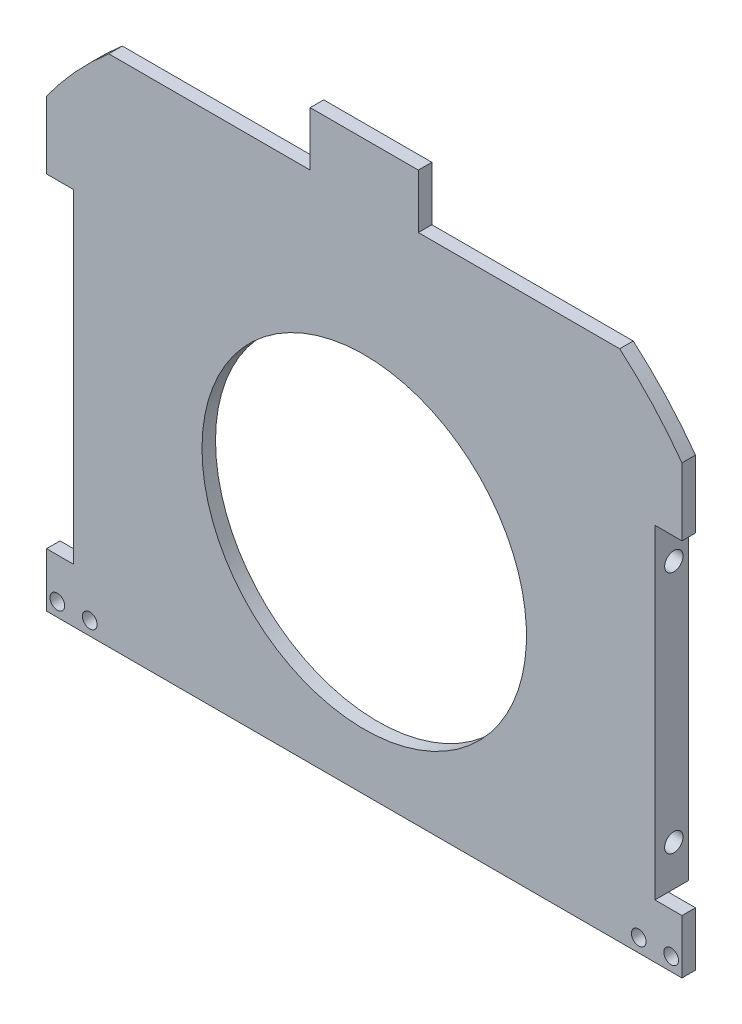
ISO-10303-21;
HEADER;
FILE_DESCRIPTION(('STEP AP214'),'2;1');
FILE_NAME('part.step','',(''),(''),'','','');
FILE_SCHEMA(('AUTOMOTIVE_DESIGN { 1 0 10303 214 1 1 1 1 }'));
ENDSEC;
DATA;
#1=APPLICATION_CONTEXT('core data for automotive mechanical design processes');
#2=APPLICATION_PROTOCOL_DEFINITION('international standard','automotive_design',2000,#1);
#3=PRODUCT_CONTEXT('',#1,'mechanical');
#4=PRODUCT('Part','Part','',(#3));
#5=PRODUCT_RELATED_PRODUCT_CATEGORY('part','',(#4));
#6=PRODUCT_DEFINITION_FORMATION('','',#4);
#7=PRODUCT_DEFINITION_CONTEXT('part definition',#1,'design');
#8=PRODUCT_DEFINITION('design','',#6,#7);
#9=PRODUCT_DEFINITION_SHAPE('','',#8);
#10=(LENGTH_UNIT() NAMED_UNIT(*) SI_UNIT(.MILLI.,.METRE.));
#11=(NAMED_UNIT(*) PLANE_ANGLE_UNIT() SI_UNIT($,.RADIAN.));
#12=(NAMED_UNIT(*) SI_UNIT($,.STERADIAN.) SOLID_ANGLE_UNIT());
#13=UNCERTAINTY_MEASURE_WITH_UNIT(LENGTH_MEASURE(1.E-05),#10,'distance_accuracy_value','');
#14=(GEOMETRIC_REPRESENTATION_CONTEXT(3) GLOBAL_UNCERTAINTY_ASSIGNED_CONTEXT((#13)) GLOBAL_UNIT_ASSIGNED_CONTEXT((#10,
#11,#12)) REPRESENTATION_CONTEXT('',''));
#15=CARTESIAN_POINT('',(0.,0.,0.));
#16=DIRECTION('',(0.,0.,1.));
#17=DIRECTION('',(1.,0.,0.));
#18=AXIS2_PLACEMENT_3D('',#15,#16,#17);
#19=CARTESIAN_POINT('',(7.93749999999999,-12.7,0.));
#20=DIRECTION('',(0.,0.,1.));
#21=DIRECTION('',(1.,0.,0.));
#22=AXIS2_PLACEMENT_3D('',#19,#20,#21);
#23=PLANE('',#22);
#24=CARTESIAN_POINT('',(7.93749999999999,-12.1424287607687,0.));
#25=DIRECTION('',(0.,0.,-1.));
#26=DIRECTION('',(-1.,0.,0.));
#27=AXIS2_PLACEMENT_3D('',#24,#25,#26);
#28=CIRCLE('',#27,38.1);
#29=CARTESIAN_POINT('',(-30.1625,-12.1424287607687,0.));
#30=VERTEX_POINT('',#29);
#31=EDGE_CURVE('E292',#30,#30,#28,.T.);
#32=ORIENTED_EDGE('',*,*,#31,.F.);
#33=EDGE_LOOP('',(#32));
#34=FACE_BOUND('',#33,.T.);
#35=CARTESIAN_POINT('',(80.01,-60.3466780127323,0.));
#36=DIRECTION('',(0.,0.,1.));
#37=DIRECTION('',(1.,0.,0.));
#38=AXIS2_PLACEMENT_3D('',#35,#36,#37);
#39=CIRCLE('',#38,1.7272);
#40=CARTESIAN_POINT('',(81.7372,-60.3466780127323,0.));
#41=VERTEX_POINT('',#40);
#42=EDGE_CURVE('E364',#41,#41,#39,.T.);
#43=ORIENTED_EDGE('',*,*,#42,.T.);
#44=EDGE_LOOP('',(#43));
#45=FACE_BOUND('',#44,.T.);
#46=CARTESIAN_POINT('',(-64.135,-60.3033219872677,0.));
#47=DIRECTION('',(0.,0.,1.));
#48=DIRECTION('',(1.,0.,0.));
#49=AXIS2_PLACEMENT_3D('',#46,#47,#48);
#50=CIRCLE('',#49,1.7272);
#51=CARTESIAN_POINT('',(-62.4078,-60.3033219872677,0.));
#52=VERTEX_POINT('',#51);
#53=EDGE_CURVE('E376',#52,#52,#50,.T.);
#54=ORIENTED_EDGE('',*,*,#53,.T.);
#55=EDGE_LOOP('',(#54));
#56=FACE_BOUND('',#55,.T.);
#57=CARTESIAN_POINT('',(-56.515,-60.3033219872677,0.));
#58=DIRECTION('',(0.,0.,1.));
#59=DIRECTION('',(1.,0.,0.));
#60=AXIS2_PLACEMENT_3D('',#57,#58,#59);
#61=CIRCLE('',#60,1.7272);
#62=CARTESIAN_POINT('',(-54.7878,-60.3033219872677,0.));
#63=VERTEX_POINT('',#62);
#64=EDGE_CURVE('E370',#63,#63,#61,.T.);
#65=ORIENTED_EDGE('',*,*,#64,.T.);
#66=EDGE_LOOP('',(#65));
#67=FACE_BOUND('',#66,.T.);
#68=CARTESIAN_POINT('',(72.39,-60.3466780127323,0.));
#69=DIRECTION('',(0.,0.,1.));
#70=DIRECTION('',(1.,0.,0.));
#71=AXIS2_PLACEMENT_3D('',#68,#69,#70);
#72=CIRCLE('',#71,1.7272);
#73=CARTESIAN_POINT('',(74.1172,-60.3466780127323,0.));
#74=VERTEX_POINT('',#73);
#75=EDGE_CURVE('E358',#74,#74,#72,.T.);
#76=ORIENTED_EDGE('',*,*,#75,.T.);
#77=EDGE_LOOP('',(#76));
#78=FACE_BOUND('',#77,.T.);
#79=DIRECTION('',(0.,1.,0.));
#80=VECTOR('',#79,1.);
#81=CARTESIAN_POINT('',(69.85,-12.7,0.));
#82=LINE('',#81,#80);
#83=CARTESIAN_POINT('',(69.85,14.1290386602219,0.));
#84=VERTEX_POINT('',#83);
#85=CARTESIAN_POINT('',(69.85,17.6209613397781,0.));
#86=VERTEX_POINT('',#85);
#87=EDGE_CURVE('E11',#84,#86,#82,.T.);
#88=ORIENTED_EDGE('',*,*,#87,.F.);
#89=DIRECTION('',(1.,0.,0.));
#90=VECTOR('',#89,1.);
#91=CARTESIAN_POINT('',(69.85,14.1290386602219,0.));
#92=LINE('',#91,#90);
#93=CARTESIAN_POINT('',(71.4375,14.1290386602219,0.));
#94=VERTEX_POINT('',#93);
#95=EDGE_CURVE('E248',#84,#94,#92,.T.);
#96=ORIENTED_EDGE('',*,*,#95,.T.);
#97=DIRECTION('',(0.,1.,0.));
#98=VECTOR('',#97,1.);
#99=CARTESIAN_POINT('',(71.4375,25.4,0.));
#100=LINE('',#99,#98);
#101=CARTESIAN_POINT('',(71.4375,-39.5290386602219,0.));
#102=VERTEX_POINT('',#101);
#103=EDGE_CURVE('E304',#102,#94,#100,.T.);
#104=ORIENTED_EDGE('',*,*,#103,.F.);
#105=DIRECTION('',(1.,0.,0.));
#106=VECTOR('',#105,1.);
#107=CARTESIAN_POINT('',(69.85,-39.5290386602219,0.));
#108=LINE('',#107,#106);
#109=CARTESIAN_POINT('',(69.85,-39.5290386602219,0.));
#110=VERTEX_POINT('',#109);
#111=EDGE_CURVE('E56',#102,#110,#108,.F.);
#112=ORIENTED_EDGE('',*,*,#111,.T.);
#113=DIRECTION('',(0.,1.,0.));
#114=VECTOR('',#113,1.);
#115=CARTESIAN_POINT('',(69.85,-12.7,0.));
#116=LINE('',#115,#114);
#117=CARTESIAN_POINT('',(69.85,-43.0209613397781,0.));
#118=VERTEX_POINT('',#117);
#119=EDGE_CURVE('E519',#118,#110,#116,.T.);
#120=ORIENTED_EDGE('',*,*,#119,.F.);
#121=DIRECTION('',(1.,0.,0.));
#122=VECTOR('',#121,1.);
#123=CARTESIAN_POINT('',(69.85,-43.0209613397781,0.));
#124=LINE('',#123,#122);
#125=CARTESIAN_POINT('',(71.4375,-43.0209613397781,0.));
#126=VERTEX_POINT('',#125);
#127=EDGE_CURVE('E265',#118,#126,#124,.T.);
#128=ORIENTED_EDGE('',*,*,#127,.T.);
#129=CARTESIAN_POINT('',(71.4375,-50.8,0.));
#130=VERTEX_POINT('',#129);
#131=EDGE_CURVE('E300',#130,#126,#100,.T.);
#132=ORIENTED_EDGE('',*,*,#131,.F.);
#133=DIRECTION('',(-1.,0.,0.));
#134=VECTOR('',#133,1.);
#135=CARTESIAN_POINT('',(76.2,-50.8,0.));
#136=LINE('',#135,#134);
#137=CARTESIAN_POINT('',(76.2,-50.8,0.));
#138=VERTEX_POINT('',#137);
#139=EDGE_CURVE('E298',#138,#130,#136,.T.);
#140=ORIENTED_EDGE('',*,*,#139,.F.);
#141=DIRECTION('',(-1.,0.,0.));
#142=VECTOR('',#141,1.);
#143=CARTESIAN_POINT('',(82.55,-50.8,0.));
#144=LINE('',#143,#142);
#145=CARTESIAN_POINT('',(82.55,-50.8,0.));
#146=VERTEX_POINT('',#145);
#147=EDGE_CURVE('E385',#146,#138,#144,.T.);
#148=ORIENTED_EDGE('',*,*,#147,.F.);
#149=DIRECTION('',(0.,1.,0.));
#150=VECTOR('',#149,1.);
#151=CARTESIAN_POINT('',(82.55,-50.8,0.));
#152=LINE('',#151,#150);
#153=CARTESIAN_POINT('',(82.55,-63.5,0.));
#154=VERTEX_POINT('',#153);
#155=EDGE_CURVE('E382',#154,#146,#152,.T.);
#156=ORIENTED_EDGE('',*,*,#155,.F.);
#157=DIRECTION('',(1.,0.,0.));
#158=VECTOR('',#157,1.);
#159=CARTESIAN_POINT('',(-66.675,-63.5,0.));
#160=LINE('',#159,#158);
#161=CARTESIAN_POINT('',(-66.675,-63.5,0.));
#162=VERTEX_POINT('',#161);
#163=EDGE_CURVE('E415',#162,#154,#160,.T.);
#164=ORIENTED_EDGE('',*,*,#163,.F.);
#165=DIRECTION('',(0.,-1.,0.));
#166=VECTOR('',#165,1.);
#167=CARTESIAN_POINT('',(-66.675,-50.8,0.));
#168=LINE('',#167,#166);
#169=CARTESIAN_POINT('',(-66.675,-50.8,0.));
#170=VERTEX_POINT('',#169);
#171=EDGE_CURVE('E413',#170,#162,#168,.T.);
#172=ORIENTED_EDGE('',*,*,#171,.F.);
#173=DIRECTION('',(-1.,0.,0.));
#174=VECTOR('',#173,1.);
#175=CARTESIAN_POINT('',(-60.325,-50.8,0.));
#176=LINE('',#175,#174);
#177=CARTESIAN_POINT('',(-60.325,-50.8,0.));
#178=VERTEX_POINT('',#177);
#179=EDGE_CURVE('E411',#178,#170,#176,.T.);
#180=ORIENTED_EDGE('',*,*,#179,.F.);
#181=DIRECTION('',(-1.,0.,0.));
#182=VECTOR('',#181,1.);
#183=CARTESIAN_POINT('',(-60.325,-50.8,0.));
#184=LINE('',#183,#182);
#185=CARTESIAN_POINT('',(-55.5625,-50.8,0.));
#186=VERTEX_POINT('',#185);
#187=EDGE_CURVE('E333',#186,#178,#184,.T.);
#188=ORIENTED_EDGE('',*,*,#187,.F.);
#189=DIRECTION('',(0.,-1.,0.));
#190=VECTOR('',#189,1.);
#191=CARTESIAN_POINT('',(-55.5625,25.4,0.));
#192=LINE('',#191,#190);
#193=CARTESIAN_POINT('',(-55.5625,-43.0209613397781,0.));
#194=VERTEX_POINT('',#193);
#195=EDGE_CURVE('E329',#194,#186,#192,.T.);
#196=ORIENTED_EDGE('',*,*,#195,.F.);
#197=DIRECTION('',(-1.,0.,0.));
#198=VECTOR('',#197,1.);
#199=CARTESIAN_POINT('',(-53.975,-43.0209613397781,0.));
#200=LINE('',#199,#198);
#201=CARTESIAN_POINT('',(-53.975,-43.0209613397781,0.));
#202=VERTEX_POINT('',#201);
#203=EDGE_CURVE('E274',#194,#202,#200,.F.);
#204=ORIENTED_EDGE('',*,*,#203,.T.);
#205=DIRECTION('',(0.,-1.,0.));
#206=VECTOR('',#205,1.);
#207=CARTESIAN_POINT('',(-53.975,-12.7,0.));
#208=LINE('',#207,#206);
#209=CARTESIAN_POINT('',(-53.975,-39.5290386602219,0.));
#210=VERTEX_POINT('',#209);
#211=EDGE_CURVE('E515',#210,#202,#208,.T.);
#212=ORIENTED_EDGE('',*,*,#211,.F.);
#213=DIRECTION('',(-1.,0.,0.));
#214=VECTOR('',#213,1.);
#215=CARTESIAN_POINT('',(-53.975,-39.5290386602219,0.));
#216=LINE('',#215,#214);
#217=CARTESIAN_POINT('',(-55.5625,-39.5290386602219,0.));
#218=VERTEX_POINT('',#217);
#219=EDGE_CURVE('E277',#210,#218,#216,.T.);
#220=ORIENTED_EDGE('',*,*,#219,.T.);
#221=CARTESIAN_POINT('',(-55.5625,14.1290386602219,0.));
#222=VERTEX_POINT('',#221);
#223=EDGE_CURVE('E334',#222,#218,#192,.T.);
#224=ORIENTED_EDGE('',*,*,#223,.F.);
#225=DIRECTION('',(-1.,0.,0.));
#226=VECTOR('',#225,1.);
#227=CARTESIAN_POINT('',(-53.975,14.1290386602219,0.));
#228=LINE('',#227,#226);
#229=CARTESIAN_POINT('',(-53.975,14.1290386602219,0.));
#230=VERTEX_POINT('',#229);
#231=EDGE_CURVE('E286',#222,#230,#228,.F.);
#232=ORIENTED_EDGE('',*,*,#231,.T.);
#233=DIRECTION('',(0.,-1.,0.));
#234=VECTOR('',#233,1.);
#235=CARTESIAN_POINT('',(-53.975,-12.7,0.));
#236=LINE('',#235,#234);
#237=CARTESIAN_POINT('',(-53.975,17.6209613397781,0.));
#238=VERTEX_POINT('',#237);
#239=EDGE_CURVE('E510',#238,#230,#236,.T.);
#240=ORIENTED_EDGE('',*,*,#239,.F.);
#241=DIRECTION('',(-1.,0.,0.));
#242=VECTOR('',#241,1.);
#243=CARTESIAN_POINT('',(-53.975,17.6209613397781,0.));
#244=LINE('',#243,#242);
#245=CARTESIAN_POINT('',(-55.5625,17.6209613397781,0.));
#246=VERTEX_POINT('',#245);
#247=EDGE_CURVE('E289',#238,#246,#244,.T.);
#248=ORIENTED_EDGE('',*,*,#247,.T.);
#249=CARTESIAN_POINT('',(-55.5625,25.4,0.));
#250=VERTEX_POINT('',#249);
#251=EDGE_CURVE('E330',#250,#246,#192,.T.);
#252=ORIENTED_EDGE('',*,*,#251,.F.);
#253=DIRECTION('',(1.,0.,0.));
#254=VECTOR('',#253,1.);
#255=CARTESIAN_POINT('',(-60.325,25.4,0.));
#256=LINE('',#255,#254);
#257=CARTESIAN_POINT('',(-60.325,25.4,0.));
#258=VERTEX_POINT('',#257);
#259=EDGE_CURVE('E326',#258,#250,#256,.T.);
#260=ORIENTED_EDGE('',*,*,#259,.F.);
#261=DIRECTION('',(1.,0.,0.));
#262=VECTOR('',#261,1.);
#263=CARTESIAN_POINT('',(-66.675,25.4,0.));
#264=LINE('',#263,#262);
#265=CARTESIAN_POINT('',(-66.675,25.4,0.));
#266=VERTEX_POINT('',#265);
#267=EDGE_CURVE('E408',#266,#258,#264,.T.);
#268=ORIENTED_EDGE('',*,*,#267,.F.);
#269=DIRECTION('',(0.,-1.,0.));
#270=VECTOR('',#269,1.);
#271=CARTESIAN_POINT('',(-66.675,25.4,0.));
#272=LINE('',#271,#270);
#273=CARTESIAN_POINT('',(-66.675,41.2516493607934,0.));
#274=VERTEX_POINT('',#273);
#275=EDGE_CURVE('E406',#274,#266,#272,.T.);
#276=ORIENTED_EDGE('',*,*,#275,.F.);
#277=CARTESIAN_POINT('',(7.93749999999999,-12.7,0.));
#278=DIRECTION('',(0.,0.,1.));
#279=DIRECTION('',(1.,0.,0.));
#280=AXIS2_PLACEMENT_3D('',#277,#278,#279);
#281=CIRCLE('',#280,92.075);
#282=CARTESIAN_POINT('',(-52.0523585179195,57.15,0.));
#283=VERTEX_POINT('',#282);
#284=EDGE_CURVE('E404',#283,#274,#281,.T.);
#285=ORIENTED_EDGE('',*,*,#284,.F.);
#286=DIRECTION('',(-1.,0.,0.));
#287=VECTOR('',#286,1.);
#288=CARTESIAN_POINT('',(-4.7625,57.15,0.));
#289=LINE('',#288,#287);
#290=CARTESIAN_POINT('',(-4.7625,57.15,0.));
#291=VERTEX_POINT('',#290);
#292=EDGE_CURVE('E402',#291,#283,#289,.T.);
#293=ORIENTED_EDGE('',*,*,#292,.F.);
#294=DIRECTION('',(0.,-1.,0.));
#295=VECTOR('',#294,1.);
#296=CARTESIAN_POINT('',(-4.76250000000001,69.85,0.));
#297=LINE('',#296,#295);
#298=CARTESIAN_POINT('',(-4.76250000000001,69.85,0.));
#299=VERTEX_POINT('',#298);
#300=EDGE_CURVE('E400',#299,#291,#297,.T.);
#301=ORIENTED_EDGE('',*,*,#300,.F.);
#302=DIRECTION('',(-1.,0.,0.));
#303=VECTOR('',#302,1.);
#304=CARTESIAN_POINT('',(-4.76250000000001,69.85,0.));
#305=LINE('',#304,#303);
#306=CARTESIAN_POINT('',(20.6375,69.85,0.));
#307=VERTEX_POINT('',#306);
#308=EDGE_CURVE('E398',#307,#299,#305,.T.);
#309=ORIENTED_EDGE('',*,*,#308,.F.);
#310=DIRECTION('',(0.,1.,0.));
#311=VECTOR('',#310,1.);
#312=CARTESIAN_POINT('',(20.6375,69.85,0.));
#313=LINE('',#312,#311);
#314=CARTESIAN_POINT('',(20.6375,57.15,0.));
#315=VERTEX_POINT('',#314);
#316=EDGE_CURVE('E396',#315,#307,#313,.T.);
#317=ORIENTED_EDGE('',*,*,#316,.F.);
#318=DIRECTION('',(-1.,0.,0.));
#319=VECTOR('',#318,1.);
#320=CARTESIAN_POINT('',(67.9273585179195,57.15,0.));
#321=LINE('',#320,#319);
#322=CARTESIAN_POINT('',(67.9273585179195,57.15,0.));
#323=VERTEX_POINT('',#322);
#324=EDGE_CURVE('E394',#323,#315,#321,.T.);
#325=ORIENTED_EDGE('',*,*,#324,.F.);
#326=CARTESIAN_POINT('',(7.93749999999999,-12.7,0.));
#327=DIRECTION('',(0.,0.,1.));
#328=DIRECTION('',(1.,0.,0.));
#329=AXIS2_PLACEMENT_3D('',#326,#327,#328);
#330=CIRCLE('',#329,92.075);
#331=CARTESIAN_POINT('',(82.55,41.2516493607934,0.));
#332=VERTEX_POINT('',#331);
#333=EDGE_CURVE('E392',#332,#323,#330,.T.);
#334=ORIENTED_EDGE('',*,*,#333,.F.);
#335=DIRECTION('',(0.,1.,0.));
#336=VECTOR('',#335,1.);
#337=CARTESIAN_POINT('',(82.55,41.2516493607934,0.));
#338=LINE('',#337,#336);
#339=CARTESIAN_POINT('',(82.55,25.4,0.));
#340=VERTEX_POINT('',#339);
#341=EDGE_CURVE('E390',#340,#332,#338,.T.);
#342=ORIENTED_EDGE('',*,*,#341,.F.);
#343=DIRECTION('',(1.,0.,0.));
#344=VECTOR('',#343,1.);
#345=CARTESIAN_POINT('',(76.2,25.4,0.));
#346=LINE('',#345,#344);
#347=CARTESIAN_POINT('',(76.2,25.4,0.));
#348=VERTEX_POINT('',#347);
#349=EDGE_CURVE('E388',#348,#340,#346,.T.);
#350=ORIENTED_EDGE('',*,*,#349,.F.);
#351=DIRECTION('',(1.,0.,0.));
#352=VECTOR('',#351,1.);
#353=CARTESIAN_POINT('',(76.2,25.4,0.));
#354=LINE('',#353,#352);
#355=CARTESIAN_POINT('',(71.4375,25.4,0.));
#356=VERTEX_POINT('',#355);
#357=EDGE_CURVE('E303',#356,#348,#354,.T.);
#358=ORIENTED_EDGE('',*,*,#357,.F.);
#359=CARTESIAN_POINT('',(71.4375,17.6209613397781,0.));
#360=VERTEX_POINT('',#359);
#361=EDGE_CURVE('E253',#360,#356,#100,.T.);
#362=ORIENTED_EDGE('',*,*,#361,.F.);
#363=DIRECTION('',(1.,0.,0.));
#364=VECTOR('',#363,1.);
#365=CARTESIAN_POINT('',(69.85,17.6209613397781,0.));
#366=LINE('',#365,#364);
#367=EDGE_CURVE('E48',#360,#86,#366,.F.);
#368=ORIENTED_EDGE('',*,*,#367,.T.);
#369=EDGE_LOOP('',(#88,#96,#104,#112,#120,#128,#132,#140,#148,#156,#164,#172,#180,#188,#196,
#204,#212,#220,#224,#232,#240,#248,#252,#260,#268,#276,#285,#293,#301,#309,#317,#325,#334,#342,
#350,#358,#362,#368));
#370=FACE_BOUND('',#369,.T.);
#371=ADVANCED_FACE('F33',(#34,#45,#56,#67,#78,#370),#23,.F.);
#372=CARTESIAN_POINT('',(7.93749999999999,-12.7,3.175));
#373=DIRECTION('',(0.,0.,1.));
#374=DIRECTION('',(1.,0.,0.));
#375=AXIS2_PLACEMENT_3D('',#372,#373,#374);
#376=PLANE('',#375);
#377=CARTESIAN_POINT('',(7.93749999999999,-12.1424287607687,3.175));
#378=DIRECTION('',(0.,0.,-1.));
#379=DIRECTION('',(-1.,0.,0.));
#380=AXIS2_PLACEMENT_3D('',#377,#378,#379);
#381=CIRCLE('',#380,38.1);
#382=CARTESIAN_POINT('',(-30.1625,-12.1424287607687,3.175));
#383=VERTEX_POINT('',#382);
#384=EDGE_CURVE('E295',#383,#383,#381,.T.);
#385=ORIENTED_EDGE('',*,*,#384,.T.);
#386=EDGE_LOOP('',(#385));
#387=FACE_BOUND('',#386,.T.);
#388=CARTESIAN_POINT('',(80.01,-60.3466780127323,3.175));
#389=DIRECTION('',(0.,0.,1.));
#390=DIRECTION('',(1.,0.,0.));
#391=AXIS2_PLACEMENT_3D('',#388,#389,#390);
#392=CIRCLE('',#391,1.7272);
#393=CARTESIAN_POINT('',(81.7372,-60.3466780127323,3.175));
#394=VERTEX_POINT('',#393);
#395=EDGE_CURVE('E367',#394,#394,#392,.T.);
#396=ORIENTED_EDGE('',*,*,#395,.F.);
#397=EDGE_LOOP('',(#396));
#398=FACE_BOUND('',#397,.T.);
#399=CARTESIAN_POINT('',(-64.135,-60.3033219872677,3.175));
#400=DIRECTION('',(0.,0.,1.));
#401=DIRECTION('',(1.,0.,0.));
#402=AXIS2_PLACEMENT_3D('',#399,#400,#401);
#403=CIRCLE('',#402,1.7272);
#404=CARTESIAN_POINT('',(-62.4078,-60.3033219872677,3.175));
#405=VERTEX_POINT('',#404);
#406=EDGE_CURVE('E379',#405,#405,#403,.T.);
#407=ORIENTED_EDGE('',*,*,#406,.F.);
#408=EDGE_LOOP('',(#407));
#409=FACE_BOUND('',#408,.T.);
#410=DIRECTION('',(0.,1.,0.));
#411=VECTOR('',#410,1.);
#412=CARTESIAN_POINT('',(82.55,-50.8,3.175));
#413=LINE('',#412,#411);
#414=CARTESIAN_POINT('',(82.55,-63.5,3.175));
#415=VERTEX_POINT('',#414);
#416=CARTESIAN_POINT('',(82.55,-50.8,3.175));
#417=VERTEX_POINT('',#416);
#418=EDGE_CURVE('E417',#415,#417,#413,.T.);
#419=ORIENTED_EDGE('',*,*,#418,.T.);
#420=DIRECTION('',(-1.,0.,0.));
#421=VECTOR('',#420,1.);
#422=CARTESIAN_POINT('',(82.55,-50.8,3.175));
#423=LINE('',#422,#421);
#424=CARTESIAN_POINT('',(76.2,-50.8,3.175));
#425=VERTEX_POINT('',#424);
#426=EDGE_CURVE('E420',#417,#425,#423,.T.);
#427=ORIENTED_EDGE('',*,*,#426,.T.);
#428=DIRECTION('',(0.,1.,0.));
#429=VECTOR('',#428,1.);
#430=CARTESIAN_POINT('',(76.2,25.4,3.175));
#431=LINE('',#430,#429);
#432=CARTESIAN_POINT('',(76.2,25.4,3.175));
#433=VERTEX_POINT('',#432);
#434=EDGE_CURVE('E422',#425,#433,#431,.T.);
#435=ORIENTED_EDGE('',*,*,#434,.T.);
#436=DIRECTION('',(1.,0.,0.));
#437=VECTOR('',#436,1.);
#438=CARTESIAN_POINT('',(76.2,25.4,3.175));
#439=LINE('',#438,#437);
#440=CARTESIAN_POINT('',(82.55,25.4,3.175));
#441=VERTEX_POINT('',#440);
#442=EDGE_CURVE('E424',#433,#441,#439,.T.);
#443=ORIENTED_EDGE('',*,*,#442,.T.);
#444=DIRECTION('',(0.,1.,0.));
#445=VECTOR('',#444,1.);
#446=CARTESIAN_POINT('',(82.55,41.2516493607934,3.175));
#447=LINE('',#446,#445);
#448=CARTESIAN_POINT('',(82.55,41.2516493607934,3.175));
#449=VERTEX_POINT('',#448);
#450=EDGE_CURVE('E426',#441,#449,#447,.T.);
#451=ORIENTED_EDGE('',*,*,#450,.T.);
#452=CARTESIAN_POINT('',(7.93749999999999,-12.7,3.175));
#453=DIRECTION('',(0.,0.,1.));
#454=DIRECTION('',(1.,0.,0.));
#455=AXIS2_PLACEMENT_3D('',#452,#453,#454);
#456=CIRCLE('',#455,92.075);
#457=CARTESIAN_POINT('',(67.9273585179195,57.15,3.175));
#458=VERTEX_POINT('',#457);
#459=EDGE_CURVE('E428',#449,#458,#456,.T.);
#460=ORIENTED_EDGE('',*,*,#459,.T.);
#461=DIRECTION('',(-1.,0.,0.));
#462=VECTOR('',#461,1.);
#463=CARTESIAN_POINT('',(67.9273585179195,57.15,3.175));
#464=LINE('',#463,#462);
#465=CARTESIAN_POINT('',(20.6375,57.15,3.175));
#466=VERTEX_POINT('',#465);
#467=EDGE_CURVE('E430',#458,#466,#464,.T.);
#468=ORIENTED_EDGE('',*,*,#467,.T.);
#469=DIRECTION('',(0.,1.,0.));
#470=VECTOR('',#469,1.);
#471=CARTESIAN_POINT('',(20.6375,69.85,3.175));
#472=LINE('',#471,#470);
#473=CARTESIAN_POINT('',(20.6375,69.85,3.175));
#474=VERTEX_POINT('',#473);
#475=EDGE_CURVE('E432',#466,#474,#472,.T.);
#476=ORIENTED_EDGE('',*,*,#475,.T.);
#477=DIRECTION('',(-1.,0.,0.));
#478=VECTOR('',#477,1.);
#479=CARTESIAN_POINT('',(-4.76250000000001,69.85,3.175));
#480=LINE('',#479,#478);
#481=CARTESIAN_POINT('',(-4.76250000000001,69.85,3.175));
#482=VERTEX_POINT('',#481);
#483=EDGE_CURVE('E434',#474,#482,#480,.T.);
#484=ORIENTED_EDGE('',*,*,#483,.T.);
#485=DIRECTION('',(0.,-1.,0.));
#486=VECTOR('',#485,1.);
#487=CARTESIAN_POINT('',(-4.76250000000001,69.85,3.175));
#488=LINE('',#487,#486);
#489=CARTESIAN_POINT('',(-4.7625,57.15,3.175));
#490=VERTEX_POINT('',#489);
#491=EDGE_CURVE('E436',#482,#490,#488,.T.);
#492=ORIENTED_EDGE('',*,*,#491,.T.);
#493=DIRECTION('',(-1.,0.,0.));
#494=VECTOR('',#493,1.);
#495=CARTESIAN_POINT('',(-4.7625,57.15,3.175));
#496=LINE('',#495,#494);
#497=CARTESIAN_POINT('',(-52.0523585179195,57.15,3.175));
#498=VERTEX_POINT('',#497);
#499=EDGE_CURVE('E438',#490,#498,#496,.T.);
#500=ORIENTED_EDGE('',*,*,#499,.T.);
#501=CARTESIAN_POINT('',(7.93749999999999,-12.7,3.175));
#502=DIRECTION('',(0.,0.,1.));
#503=DIRECTION('',(1.,0.,0.));
#504=AXIS2_PLACEMENT_3D('',#501,#502,#503);
#505=CIRCLE('',#504,92.075);
#506=CARTESIAN_POINT('',(-66.675,41.2516493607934,3.175));
#507=VERTEX_POINT('',#506);
#508=EDGE_CURVE('E440',#498,#507,#505,.T.);
#509=ORIENTED_EDGE('',*,*,#508,.T.);
#510=DIRECTION('',(0.,-1.,0.));
#511=VECTOR('',#510,1.);
#512=CARTESIAN_POINT('',(-66.675,25.4,3.175));
#513=LINE('',#512,#511);
#514=CARTESIAN_POINT('',(-66.675,25.4,3.175));
#515=VERTEX_POINT('',#514);
#516=EDGE_CURVE('E442',#507,#515,#513,.T.);
#517=ORIENTED_EDGE('',*,*,#516,.T.);
#518=DIRECTION('',(1.,0.,0.));
#519=VECTOR('',#518,1.);
#520=CARTESIAN_POINT('',(-66.675,25.4,3.175));
#521=LINE('',#520,#519);
#522=CARTESIAN_POINT('',(-60.325,25.4,3.175));
#523=VERTEX_POINT('',#522);
#524=EDGE_CURVE('E444',#515,#523,#521,.T.);
#525=ORIENTED_EDGE('',*,*,#524,.T.);
#526=DIRECTION('',(0.,-1.,0.));
#527=VECTOR('',#526,1.);
#528=CARTESIAN_POINT('',(-60.325,25.4,3.175));
#529=LINE('',#528,#527);
#530=CARTESIAN_POINT('',(-60.325,-50.8,3.175));
#531=VERTEX_POINT('',#530);
#532=EDGE_CURVE('E446',#523,#531,#529,.T.);
#533=ORIENTED_EDGE('',*,*,#532,.T.);
#534=DIRECTION('',(-1.,0.,0.));
#535=VECTOR('',#534,1.);
#536=CARTESIAN_POINT('',(-60.325,-50.8,3.175));
#537=LINE('',#536,#535);
#538=CARTESIAN_POINT('',(-66.675,-50.8,3.175));
#539=VERTEX_POINT('',#538);
#540=EDGE_CURVE('E448',#531,#539,#537,.T.);
#541=ORIENTED_EDGE('',*,*,#540,.T.);
#542=DIRECTION('',(0.,-1.,0.));
#543=VECTOR('',#542,1.);
#544=CARTESIAN_POINT('',(-66.675,-50.8,3.175));
#545=LINE('',#544,#543);
#546=CARTESIAN_POINT('',(-66.675,-63.5,3.175));
#547=VERTEX_POINT('',#546);
#548=EDGE_CURVE('E450',#539,#547,#545,.T.);
#549=ORIENTED_EDGE('',*,*,#548,.T.);
#550=DIRECTION('',(1.,0.,0.));
#551=VECTOR('',#550,1.);
#552=CARTESIAN_POINT('',(-66.675,-63.5,3.175));
#553=LINE('',#552,#551);
#554=EDGE_CURVE('E452',#547,#415,#553,.T.);
#555=ORIENTED_EDGE('',*,*,#554,.T.);
#556=EDGE_LOOP('',(#419,#427,#435,#443,#451,#460,#468,#476,#484,#492,#500,#509,#517,#525,#533,
#541,#549,#555));
#557=FACE_BOUND('',#556,.T.);
#558=CARTESIAN_POINT('',(-56.515,-60.3033219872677,3.175));
#559=DIRECTION('',(0.,0.,1.));
#560=DIRECTION('',(1.,0.,0.));
#561=AXIS2_PLACEMENT_3D('',#558,#559,#560);
#562=CIRCLE('',#561,1.7272);
#563=CARTESIAN_POINT('',(-54.7878,-60.3033219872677,3.175));
#564=VERTEX_POINT('',#563);
#565=EDGE_CURVE('E373',#564,#564,#562,.T.);
#566=ORIENTED_EDGE('',*,*,#565,.F.);
#567=EDGE_LOOP('',(#566));
#568=FACE_BOUND('',#567,.T.);
#569=CARTESIAN_POINT('',(72.39,-60.3466780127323,3.175));
#570=DIRECTION('',(0.,0.,1.));
#571=DIRECTION('',(1.,0.,0.));
#572=AXIS2_PLACEMENT_3D('',#569,#570,#571);
#573=CIRCLE('',#572,1.7272);
#574=CARTESIAN_POINT('',(74.1172,-60.3466780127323,3.175));
#575=VERTEX_POINT('',#574);
#576=EDGE_CURVE('E361',#575,#575,#573,.T.);
#577=ORIENTED_EDGE('',*,*,#576,.F.);
#578=EDGE_LOOP('',(#577));
#579=FACE_BOUND('',#578,.T.);
#580=ADVANCED_FACE('F547',(#387,#398,#409,#557,#568,#579),#376,.T.);
#581=CARTESIAN_POINT('',(82.55,-50.8,3.175));
#582=DIRECTION('',(-1.,0.,0.));
#583=DIRECTION('',(0.,-1.,0.));
#584=AXIS2_PLACEMENT_3D('',#581,#582,#583);
#585=PLANE('',#584);
#586=ORIENTED_EDGE('',*,*,#155,.T.);
#587=DIRECTION('',(0.,0.,-1.));
#588=VECTOR('',#587,1.);
#589=CARTESIAN_POINT('',(82.55,-50.8,3.175));
#590=LINE('',#589,#588);
#591=EDGE_CURVE('E504',#417,#146,#590,.T.);
#592=ORIENTED_EDGE('',*,*,#591,.F.);
#593=ORIENTED_EDGE('',*,*,#418,.F.);
#594=DIRECTION('',(0.,0.,-1.));
#595=VECTOR('',#594,1.);
#596=CARTESIAN_POINT('',(82.55,-63.5,3.175));
#597=LINE('',#596,#595);
#598=EDGE_CURVE('E454',#415,#154,#597,.T.);
#599=ORIENTED_EDGE('',*,*,#598,.T.);
#600=EDGE_LOOP('',(#586,#592,#593,#599));
#601=FACE_BOUND('',#600,.T.);
#602=ADVANCED_FACE('F35',(#601),#585,.F.);
#603=CARTESIAN_POINT('',(82.55,-50.8,3.175));
#604=DIRECTION('',(0.,-1.,0.));
#605=DIRECTION('',(0.,0.,-1.));
#606=AXIS2_PLACEMENT_3D('',#603,#604,#605);
#607=PLANE('',#606);
#608=ORIENTED_EDGE('',*,*,#147,.T.);
#609=DIRECTION('',(0.,0.,-1.));
#610=VECTOR('',#609,1.);
#611=CARTESIAN_POINT('',(76.2,-50.8,3.175));
#612=LINE('',#611,#610);
#613=EDGE_CURVE('E501',#425,#138,#612,.T.);
#614=ORIENTED_EDGE('',*,*,#613,.F.);
#615=ORIENTED_EDGE('',*,*,#426,.F.);
#616=ORIENTED_EDGE('',*,*,#591,.T.);
#617=EDGE_LOOP('',(#608,#614,#615,#616));
#618=FACE_BOUND('',#617,.T.);
#619=ADVANCED_FACE('F537',(#618),#607,.F.);
#620=CARTESIAN_POINT('',(76.2,25.4,3.175));
#621=DIRECTION('',(-1.,0.,0.));
#622=DIRECTION('',(0.,-1.,0.));
#623=AXIS2_PLACEMENT_3D('',#620,#621,#622);
#624=PLANE('',#623);
#625=CARTESIAN_POINT('',(76.2,15.875,-1.2700000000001));
#626=DIRECTION('',(1.,0.,0.));
#627=DIRECTION('',(0.,1.,0.));
#628=AXIS2_PLACEMENT_3D('',#625,#626,#627);
#629=CIRCLE('',#628,2.15900000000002);
#630=CARTESIAN_POINT('',(76.2,18.034,-1.2700000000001));
#631=VERTEX_POINT('',#630);
#632=EDGE_CURVE('E249',#631,#631,#629,.T.);
#633=ORIENTED_EDGE('',*,*,#632,.F.);
#634=EDGE_LOOP('',(#633));
#635=FACE_BOUND('',#634,.T.);
#636=CARTESIAN_POINT('',(76.2,-41.275,-1.2700000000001));
#637=DIRECTION('',(1.,0.,0.));
#638=DIRECTION('',(0.,1.,0.));
#639=AXIS2_PLACEMENT_3D('',#636,#637,#638);
#640=CIRCLE('',#639,2.15900000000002);
#641=CARTESIAN_POINT('',(76.2,-39.116,-1.2700000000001));
#642=VERTEX_POINT('',#641);
#643=EDGE_CURVE('E255',#642,#642,#640,.T.);
#644=ORIENTED_EDGE('',*,*,#643,.F.);
#645=EDGE_LOOP('',(#644));
#646=FACE_BOUND('',#645,.T.);
#647=ORIENTED_EDGE('',*,*,#613,.T.);
#648=DIRECTION('',(0.,0.,1.));
#649=VECTOR('',#648,1.);
#650=CARTESIAN_POINT('',(76.2,-50.8,-4.7625));
#651=LINE('',#650,#649);
#652=CARTESIAN_POINT('',(76.2,-50.8,-4.7625));
#653=VERTEX_POINT('',#652);
#654=EDGE_CURVE('E324',#653,#138,#651,.T.);
#655=ORIENTED_EDGE('',*,*,#654,.F.);
#656=DIRECTION('',(0.,-1.,0.));
#657=VECTOR('',#656,1.);
#658=CARTESIAN_POINT('',(76.2,25.4,-4.7625));
#659=LINE('',#658,#657);
#660=CARTESIAN_POINT('',(76.2,25.4,-4.7625));
#661=VERTEX_POINT('',#660);
#662=EDGE_CURVE('E307',#661,#653,#659,.T.);
#663=ORIENTED_EDGE('',*,*,#662,.F.);
#664=DIRECTION('',(0.,0.,1.));
#665=VECTOR('',#664,1.);
#666=CARTESIAN_POINT('',(76.2,25.4,-4.7625));
#667=LINE('',#666,#665);
#668=EDGE_CURVE('E316',#661,#348,#667,.T.);
#669=ORIENTED_EDGE('',*,*,#668,.T.);
#670=DIRECTION('',(0.,0.,-1.));
#671=VECTOR('',#670,1.);
#672=CARTESIAN_POINT('',(76.2,25.4,3.175));
#673=LINE('',#672,#671);
#674=EDGE_CURVE('E498',#433,#348,#673,.T.);
#675=ORIENTED_EDGE('',*,*,#674,.F.);
#676=ORIENTED_EDGE('',*,*,#434,.F.);
#677=EDGE_LOOP('',(#647,#655,#663,#669,#675,#676));
#678=FACE_BOUND('',#677,.T.);
#679=ADVANCED_FACE('F542',(#635,#646,#678),#624,.F.);
#680=CARTESIAN_POINT('',(76.2,25.4,3.175));
#681=DIRECTION('',(0.,1.,0.));
#682=DIRECTION('',(0.,0.,1.));
#683=AXIS2_PLACEMENT_3D('',#680,#681,#682);
#684=PLANE('',#683);
#685=ORIENTED_EDGE('',*,*,#349,.T.);
#686=DIRECTION('',(0.,0.,-1.));
#687=VECTOR('',#686,1.);
#688=CARTESIAN_POINT('',(82.55,25.4,3.175));
#689=LINE('',#688,#687);
#690=EDGE_CURVE('E495',#441,#340,#689,.T.);
#691=ORIENTED_EDGE('',*,*,#690,.F.);
#692=ORIENTED_EDGE('',*,*,#442,.F.);
#693=ORIENTED_EDGE('',*,*,#674,.T.);
#694=EDGE_LOOP('',(#685,#691,#692,#693));
#695=FACE_BOUND('',#694,.T.);
#696=ADVANCED_FACE('F670',(#695),#684,.F.);
#697=CARTESIAN_POINT('',(82.55,41.2516493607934,3.175));
#698=DIRECTION('',(-1.,0.,0.));
#699=DIRECTION('',(0.,0.,1.));
#700=AXIS2_PLACEMENT_3D('',#697,#698,#699);
#701=PLANE('',#700);
#702=ORIENTED_EDGE('',*,*,#341,.T.);
#703=DIRECTION('',(0.,0.,-1.));
#704=VECTOR('',#703,1.);
#705=CARTESIAN_POINT('',(82.55,41.2516493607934,3.175));
#706=LINE('',#705,#704);
#707=EDGE_CURVE('E492',#449,#332,#706,.T.);
#708=ORIENTED_EDGE('',*,*,#707,.F.);
#709=ORIENTED_EDGE('',*,*,#450,.F.);
#710=ORIENTED_EDGE('',*,*,#690,.T.);
#711=EDGE_LOOP('',(#702,#708,#709,#710));
#712=FACE_BOUND('',#711,.T.);
#713=ADVANCED_FACE('F666',(#712),#701,.F.);
#714=CARTESIAN_POINT('',(7.93749999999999,-12.7,3.175));
#715=DIRECTION('',(0.,0.,-1.));
#716=DIRECTION('',(-1.,0.,0.));
#717=AXIS2_PLACEMENT_3D('',#714,#715,#716);
#718=CYLINDRICAL_SURFACE('',#717,92.075);
#719=ORIENTED_EDGE('',*,*,#333,.T.);
#720=DIRECTION('',(0.,0.,-1.));
#721=VECTOR('',#720,1.);
#722=CARTESIAN_POINT('',(67.9273585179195,57.15,3.175));
#723=LINE('',#722,#721);
#724=EDGE_CURVE('E489',#458,#323,#723,.T.);
#725=ORIENTED_EDGE('',*,*,#724,.F.);
#726=ORIENTED_EDGE('',*,*,#459,.F.);
#727=ORIENTED_EDGE('',*,*,#707,.T.);
#728=EDGE_LOOP('',(#719,#725,#726,#727));
#729=FACE_BOUND('',#728,.T.);
#730=ADVANCED_FACE('F662',(#729),#718,.T.);
#731=CARTESIAN_POINT('',(67.9273585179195,57.15,3.175));
#732=DIRECTION('',(0.,-1.,0.));
#733=DIRECTION('',(0.,0.,-1.));
#734=AXIS2_PLACEMENT_3D('',#731,#732,#733);
#735=PLANE('',#734);
#736=ORIENTED_EDGE('',*,*,#324,.T.);
#737=DIRECTION('',(0.,0.,-1.));
#738=VECTOR('',#737,1.);
#739=CARTESIAN_POINT('',(20.6375,57.15,3.175));
#740=LINE('',#739,#738);
#741=EDGE_CURVE('E486',#466,#315,#740,.T.);
#742=ORIENTED_EDGE('',*,*,#741,.F.);
#743=ORIENTED_EDGE('',*,*,#467,.F.);
#744=ORIENTED_EDGE('',*,*,#724,.T.);
#745=EDGE_LOOP('',(#736,#742,#743,#744));
#746=FACE_BOUND('',#745,.T.);
#747=ADVANCED_FACE('F658',(#746),#735,.F.);
#748=CARTESIAN_POINT('',(20.6375,69.85,3.175));
#749=DIRECTION('',(-1.,0.,0.));
#750=DIRECTION('',(0.,-1.,0.));
#751=AXIS2_PLACEMENT_3D('',#748,#749,#750);
#752=PLANE('',#751);
#753=ORIENTED_EDGE('',*,*,#316,.T.);
#754=DIRECTION('',(0.,0.,-1.));
#755=VECTOR('',#754,1.);
#756=CARTESIAN_POINT('',(20.6375,69.85,3.175));
#757=LINE('',#756,#755);
#758=EDGE_CURVE('E483',#474,#307,#757,.T.);
#759=ORIENTED_EDGE('',*,*,#758,.F.);
#760=ORIENTED_EDGE('',*,*,#475,.F.);
#761=ORIENTED_EDGE('',*,*,#741,.T.);
#762=EDGE_LOOP('',(#753,#759,#760,#761));
#763=FACE_BOUND('',#762,.T.);
#764=ADVANCED_FACE('F654',(#763),#752,.F.);
#765=CARTESIAN_POINT('',(-4.76250000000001,69.85,3.175));
#766=DIRECTION('',(0.,-1.,0.));
#767=DIRECTION('',(0.,0.,-1.));
#768=AXIS2_PLACEMENT_3D('',#765,#766,#767);
#769=PLANE('',#768);
#770=ORIENTED_EDGE('',*,*,#308,.T.);
#771=DIRECTION('',(0.,0.,-1.));
#772=VECTOR('',#771,1.);
#773=CARTESIAN_POINT('',(-4.76250000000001,69.85,3.175));
#774=LINE('',#773,#772);
#775=EDGE_CURVE('E480',#482,#299,#774,.T.);
#776=ORIENTED_EDGE('',*,*,#775,.F.);
#777=ORIENTED_EDGE('',*,*,#483,.F.);
#778=ORIENTED_EDGE('',*,*,#758,.T.);
#779=EDGE_LOOP('',(#770,#776,#777,#778));
#780=FACE_BOUND('',#779,.T.);
#781=ADVANCED_FACE('F650',(#780),#769,.F.);
#782=CARTESIAN_POINT('',(-4.76250000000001,69.85,3.175));
#783=DIRECTION('',(1.,0.,0.));
#784=DIRECTION('',(0.,1.,0.));
#785=AXIS2_PLACEMENT_3D('',#782,#783,#784);
#786=PLANE('',#785);
#787=ORIENTED_EDGE('',*,*,#300,.T.);
#788=DIRECTION('',(0.,0.,-1.));
#789=VECTOR('',#788,1.);
#790=CARTESIAN_POINT('',(-4.7625,57.15,3.175));
#791=LINE('',#790,#789);
#792=EDGE_CURVE('E477',#490,#291,#791,.T.);
#793=ORIENTED_EDGE('',*,*,#792,.F.);
#794=ORIENTED_EDGE('',*,*,#491,.F.);
#795=ORIENTED_EDGE('',*,*,#775,.T.);
#796=EDGE_LOOP('',(#787,#793,#794,#795));
#797=FACE_BOUND('',#796,.T.);
#798=ADVANCED_FACE('F646',(#797),#786,.F.);
#799=CARTESIAN_POINT('',(-4.7625,57.15,3.175));
#800=DIRECTION('',(0.,-1.,0.));
#801=DIRECTION('',(0.,0.,-1.));
#802=AXIS2_PLACEMENT_3D('',#799,#800,#801);
#803=PLANE('',#802);
#804=ORIENTED_EDGE('',*,*,#292,.T.);
#805=DIRECTION('',(0.,0.,-1.));
#806=VECTOR('',#805,1.);
#807=CARTESIAN_POINT('',(-52.0523585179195,57.15,3.175));
#808=LINE('',#807,#806);
#809=EDGE_CURVE('E474',#498,#283,#808,.T.);
#810=ORIENTED_EDGE('',*,*,#809,.F.);
#811=ORIENTED_EDGE('',*,*,#499,.F.);
#812=ORIENTED_EDGE('',*,*,#792,.T.);
#813=EDGE_LOOP('',(#804,#810,#811,#812));
#814=FACE_BOUND('',#813,.T.);
#815=ADVANCED_FACE('F642',(#814),#803,.F.);
#816=CARTESIAN_POINT('',(7.93749999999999,-12.7,3.175));
#817=DIRECTION('',(0.,0.,-1.));
#818=DIRECTION('',(-1.,0.,0.));
#819=AXIS2_PLACEMENT_3D('',#816,#817,#818);
#820=CYLINDRICAL_SURFACE('',#819,92.075);
#821=ORIENTED_EDGE('',*,*,#284,.T.);
#822=DIRECTION('',(0.,0.,-1.));
#823=VECTOR('',#822,1.);
#824=CARTESIAN_POINT('',(-66.675,41.2516493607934,3.175));
#825=LINE('',#824,#823);
#826=EDGE_CURVE('E471',#507,#274,#825,.T.);
#827=ORIENTED_EDGE('',*,*,#826,.F.);
#828=ORIENTED_EDGE('',*,*,#508,.F.);
#829=ORIENTED_EDGE('',*,*,#809,.T.);
#830=EDGE_LOOP('',(#821,#827,#828,#829));
#831=FACE_BOUND('',#830,.T.);
#832=ADVANCED_FACE('F638',(#831),#820,.T.);
#833=CARTESIAN_POINT('',(-66.675,25.4,3.175));
#834=DIRECTION('',(1.,0.,0.));
#835=DIRECTION('',(0.,0.,-1.));
#836=AXIS2_PLACEMENT_3D('',#833,#834,#835);
#837=PLANE('',#836);
#838=ORIENTED_EDGE('',*,*,#275,.T.);
#839=DIRECTION('',(0.,0.,-1.));
#840=VECTOR('',#839,1.);
#841=CARTESIAN_POINT('',(-66.675,25.4,3.175));
#842=LINE('',#841,#840);
#843=EDGE_CURVE('E468',#515,#266,#842,.T.);
#844=ORIENTED_EDGE('',*,*,#843,.F.);
#845=ORIENTED_EDGE('',*,*,#516,.F.);
#846=ORIENTED_EDGE('',*,*,#826,.T.);
#847=EDGE_LOOP('',(#838,#844,#845,#846));
#848=FACE_BOUND('',#847,.T.);
#849=ADVANCED_FACE('F634',(#848),#837,.F.);
#850=CARTESIAN_POINT('',(-66.675,25.4,3.175));
#851=DIRECTION('',(0.,1.,0.));
#852=DIRECTION('',(0.,0.,1.));
#853=AXIS2_PLACEMENT_3D('',#850,#851,#852);
#854=PLANE('',#853);
#855=ORIENTED_EDGE('',*,*,#267,.T.);
#856=DIRECTION('',(0.,0.,-1.));
#857=VECTOR('',#856,1.);
#858=CARTESIAN_POINT('',(-60.325,25.4,3.175));
#859=LINE('',#858,#857);
#860=EDGE_CURVE('E465',#523,#258,#859,.T.);
#861=ORIENTED_EDGE('',*,*,#860,.F.);
#862=ORIENTED_EDGE('',*,*,#524,.F.);
#863=ORIENTED_EDGE('',*,*,#843,.T.);
#864=EDGE_LOOP('',(#855,#861,#862,#863));
#865=FACE_BOUND('',#864,.T.);
#866=ADVANCED_FACE('F630',(#865),#854,.F.);
#867=CARTESIAN_POINT('',(-60.325,25.4,3.175));
#868=DIRECTION('',(1.,0.,0.));
#869=DIRECTION('',(0.,1.,0.));
#870=AXIS2_PLACEMENT_3D('',#867,#868,#869);
#871=PLANE('',#870);
#872=CARTESIAN_POINT('',(-60.325,-41.275,-1.2700000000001));
#873=DIRECTION('',(-1.,0.,0.));
#874=DIRECTION('',(0.,-1.,0.));
#875=AXIS2_PLACEMENT_3D('',#872,#873,#874);
#876=CIRCLE('',#875,2.15900000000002);
#877=CARTESIAN_POINT('',(-60.325,-43.434,-1.2700000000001));
#878=VERTEX_POINT('',#877);
#879=EDGE_CURVE('E268',#878,#878,#876,.T.);
#880=ORIENTED_EDGE('',*,*,#879,.F.);
#881=EDGE_LOOP('',(#880));
#882=FACE_BOUND('',#881,.T.);
#883=CARTESIAN_POINT('',(-60.325,15.875,-1.2700000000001));
#884=DIRECTION('',(-1.,0.,0.));
#885=DIRECTION('',(0.,-1.,0.));
#886=AXIS2_PLACEMENT_3D('',#883,#884,#885);
#887=CIRCLE('',#886,2.15900000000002);
#888=CARTESIAN_POINT('',(-60.325,13.716,-1.2700000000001));
#889=VERTEX_POINT('',#888);
#890=EDGE_CURVE('E280',#889,#889,#887,.T.);
#891=ORIENTED_EDGE('',*,*,#890,.F.);
#892=EDGE_LOOP('',(#891));
#893=FACE_BOUND('',#892,.T.);
#894=ORIENTED_EDGE('',*,*,#860,.T.);
#895=DIRECTION('',(0.,0.,1.));
#896=VECTOR('',#895,1.);
#897=CARTESIAN_POINT('',(-60.325,25.4,-4.7625));
#898=LINE('',#897,#896);
#899=CARTESIAN_POINT('',(-60.325,25.4,-4.7625));
#900=VERTEX_POINT('',#899);
#901=EDGE_CURVE('E355',#900,#258,#898,.T.);
#902=ORIENTED_EDGE('',*,*,#901,.F.);
#903=DIRECTION('',(0.,1.,0.));
#904=VECTOR('',#903,1.);
#905=CARTESIAN_POINT('',(-60.325,25.4,-4.7625));
#906=LINE('',#905,#904);
#907=CARTESIAN_POINT('',(-60.325,-50.8,-4.7625));
#908=VERTEX_POINT('',#907);
#909=EDGE_CURVE('E337',#908,#900,#906,.T.);
#910=ORIENTED_EDGE('',*,*,#909,.F.);
#911=DIRECTION('',(0.,0.,1.));
#912=VECTOR('',#911,1.);
#913=CARTESIAN_POINT('',(-60.325,-50.8,-4.7625));
#914=LINE('',#913,#912);
#915=EDGE_CURVE('E346',#908,#178,#914,.T.);
#916=ORIENTED_EDGE('',*,*,#915,.T.);
#917=DIRECTION('',(0.,0.,-1.));
#918=VECTOR('',#917,1.);
#919=CARTESIAN_POINT('',(-60.325,-50.8,3.175));
#920=LINE('',#919,#918);
#921=EDGE_CURVE('E463',#531,#178,#920,.T.);
#922=ORIENTED_EDGE('',*,*,#921,.F.);
#923=ORIENTED_EDGE('',*,*,#532,.F.);
#924=EDGE_LOOP('',(#894,#902,#910,#916,#922,#923));
#925=FACE_BOUND('',#924,.T.);
#926=ADVANCED_FACE('F577',(#882,#893,#925),#871,.F.);
#927=CARTESIAN_POINT('',(-60.325,-50.8,3.175));
#928=DIRECTION('',(0.,-1.,0.));
#929=DIRECTION('',(0.,0.,-1.));
#930=AXIS2_PLACEMENT_3D('',#927,#928,#929);
#931=PLANE('',#930);
#932=ORIENTED_EDGE('',*,*,#179,.T.);
#933=DIRECTION('',(0.,0.,-1.));
#934=VECTOR('',#933,1.);
#935=CARTESIAN_POINT('',(-66.675,-50.8,3.175));
#936=LINE('',#935,#934);
#937=EDGE_CURVE('E460',#539,#170,#936,.T.);
#938=ORIENTED_EDGE('',*,*,#937,.F.);
#939=ORIENTED_EDGE('',*,*,#540,.F.);
#940=ORIENTED_EDGE('',*,*,#921,.T.);
#941=EDGE_LOOP('',(#932,#938,#939,#940));
#942=FACE_BOUND('',#941,.T.);
#943=ADVANCED_FACE('F566',(#942),#931,.F.);
#944=CARTESIAN_POINT('',(-66.675,-50.8,3.175));
#945=DIRECTION('',(1.,0.,0.));
#946=DIRECTION('',(0.,0.,-1.));
#947=AXIS2_PLACEMENT_3D('',#944,#945,#946);
#948=PLANE('',#947);
#949=ORIENTED_EDGE('',*,*,#171,.T.);
#950=DIRECTION('',(0.,0.,-1.));
#951=VECTOR('',#950,1.);
#952=CARTESIAN_POINT('',(-66.675,-63.5,3.175));
#953=LINE('',#952,#951);
#954=EDGE_CURVE('E457',#547,#162,#953,.T.);
#955=ORIENTED_EDGE('',*,*,#954,.F.);
#956=ORIENTED_EDGE('',*,*,#548,.F.);
#957=ORIENTED_EDGE('',*,*,#937,.T.);
#958=EDGE_LOOP('',(#949,#955,#956,#957));
#959=FACE_BOUND('',#958,.T.);
#960=ADVANCED_FACE('F562',(#959),#948,.F.);
#961=CARTESIAN_POINT('',(-66.675,-63.5,3.175));
#962=DIRECTION('',(0.,1.,0.));
#963=DIRECTION('',(0.,0.,1.));
#964=AXIS2_PLACEMENT_3D('',#961,#962,#963);
#965=PLANE('',#964);
#966=ORIENTED_EDGE('',*,*,#163,.T.);
#967=ORIENTED_EDGE('',*,*,#598,.F.);
#968=ORIENTED_EDGE('',*,*,#554,.F.);
#969=ORIENTED_EDGE('',*,*,#954,.T.);
#970=EDGE_LOOP('',(#966,#967,#968,#969));
#971=FACE_BOUND('',#970,.T.);
#972=ADVANCED_FACE('F558',(#971),#965,.F.);
#973=CARTESIAN_POINT('',(-64.135,-60.3033219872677,3.175));
#974=DIRECTION('',(0.,0.,-1.));
#975=DIRECTION('',(-1.,0.,0.));
#976=AXIS2_PLACEMENT_3D('',#973,#974,#975);
#977=CYLINDRICAL_SURFACE('',#976,1.7272);
#978=ORIENTED_EDGE('',*,*,#406,.T.);
#979=EDGE_LOOP('',(#978));
#980=FACE_BOUND('',#979,.T.);
#981=ORIENTED_EDGE('',*,*,#53,.F.);
#982=EDGE_LOOP('',(#981));
#983=FACE_BOUND('',#982,.T.);
#984=ADVANCED_FACE('F619',(#980,#983),#977,.F.);
#985=CARTESIAN_POINT('',(-56.515,-60.3033219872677,3.175));
#986=DIRECTION('',(0.,0.,-1.));
#987=DIRECTION('',(-1.,0.,0.));
#988=AXIS2_PLACEMENT_3D('',#985,#986,#987);
#989=CYLINDRICAL_SURFACE('',#988,1.7272);
#990=ORIENTED_EDGE('',*,*,#565,.T.);
#991=EDGE_LOOP('',(#990));
#992=FACE_BOUND('',#991,.T.);
#993=ORIENTED_EDGE('',*,*,#64,.F.);
#994=EDGE_LOOP('',(#993));
#995=FACE_BOUND('',#994,.T.);
#996=ADVANCED_FACE('F838',(#992,#995),#989,.F.);
#997=CARTESIAN_POINT('',(80.01,-60.3466780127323,3.175));
#998=DIRECTION('',(0.,0.,-1.));
#999=DIRECTION('',(-1.,0.,0.));
#1000=AXIS2_PLACEMENT_3D('',#997,#998,#999);
#1001=CYLINDRICAL_SURFACE('',#1000,1.7272);
#1002=ORIENTED_EDGE('',*,*,#395,.T.);
#1003=EDGE_LOOP('',(#1002));
#1004=FACE_BOUND('',#1003,.T.);
#1005=ORIENTED_EDGE('',*,*,#42,.F.);
#1006=EDGE_LOOP('',(#1005));
#1007=FACE_BOUND('',#1006,.T.);
#1008=ADVANCED_FACE('F835',(#1004,#1007),#1001,.F.);
#1009=CARTESIAN_POINT('',(72.39,-60.3466780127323,3.175));
#1010=DIRECTION('',(0.,0.,-1.));
#1011=DIRECTION('',(-1.,0.,0.));
#1012=AXIS2_PLACEMENT_3D('',#1009,#1010,#1011);
#1013=CYLINDRICAL_SURFACE('',#1012,1.7272);
#1014=ORIENTED_EDGE('',*,*,#576,.T.);
#1015=EDGE_LOOP('',(#1014));
#1016=FACE_BOUND('',#1015,.T.);
#1017=ORIENTED_EDGE('',*,*,#75,.F.);
#1018=EDGE_LOOP('',(#1017));
#1019=FACE_BOUND('',#1018,.T.);
#1020=ADVANCED_FACE('F831',(#1016,#1019),#1013,.F.);
#1021=CARTESIAN_POINT('',(-60.325,25.4,-4.7625));
#1022=DIRECTION('',(0.,-1.,0.));
#1023=DIRECTION('',(0.,0.,-1.));
#1024=AXIS2_PLACEMENT_3D('',#1021,#1022,#1023);
#1025=PLANE('',#1024);
#1026=ORIENTED_EDGE('',*,*,#259,.T.);
#1027=DIRECTION('',(0.,0.,1.));
#1028=VECTOR('',#1027,1.);
#1029=CARTESIAN_POINT('',(-55.5625,25.4,-4.7625));
#1030=LINE('',#1029,#1028);
#1031=CARTESIAN_POINT('',(-55.5625,25.4,-4.7625));
#1032=VERTEX_POINT('',#1031);
#1033=EDGE_CURVE('E352',#1032,#250,#1030,.T.);
#1034=ORIENTED_EDGE('',*,*,#1033,.F.);
#1035=DIRECTION('',(1.,0.,0.));
#1036=VECTOR('',#1035,1.);
#1037=CARTESIAN_POINT('',(-60.325,25.4,-4.7625));
#1038=LINE('',#1037,#1036);
#1039=EDGE_CURVE('E340',#900,#1032,#1038,.T.);
#1040=ORIENTED_EDGE('',*,*,#1039,.F.);
#1041=ORIENTED_EDGE('',*,*,#901,.T.);
#1042=EDGE_LOOP('',(#1026,#1034,#1040,#1041));
#1043=FACE_BOUND('',#1042,.T.);
#1044=ADVANCED_FACE('F724',(#1043),#1025,.F.);
#1045=CARTESIAN_POINT('',(-55.5625,25.4,-4.7625));
#1046=DIRECTION('',(-1.,0.,0.));
#1047=DIRECTION('',(0.,-1.,0.));
#1048=AXIS2_PLACEMENT_3D('',#1045,#1046,#1047);
#1049=PLANE('',#1048);
#1050=ORIENTED_EDGE('',*,*,#223,.T.);
#1051=CARTESIAN_POINT('',(-55.5625,-41.275,-1.2700000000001));
#1052=DIRECTION('',(-1.,0.,0.));
#1053=DIRECTION('',(0.,-1.,0.));
#1054=AXIS2_PLACEMENT_3D('',#1051,#1052,#1053);
#1055=CIRCLE('',#1054,2.15900000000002);
#1056=EDGE_CURVE('E512',#218,#194,#1055,.T.);
#1057=ORIENTED_EDGE('',*,*,#1056,.T.);
#1058=ORIENTED_EDGE('',*,*,#195,.T.);
#1059=DIRECTION('',(0.,0.,1.));
#1060=VECTOR('',#1059,1.);
#1061=CARTESIAN_POINT('',(-55.5625,-50.8,-4.7625));
#1062=LINE('',#1061,#1060);
#1063=CARTESIAN_POINT('',(-55.5625,-50.8,-4.7625));
#1064=VERTEX_POINT('',#1063);
#1065=EDGE_CURVE('E349',#1064,#186,#1062,.T.);
#1066=ORIENTED_EDGE('',*,*,#1065,.F.);
#1067=DIRECTION('',(0.,-1.,0.));
#1068=VECTOR('',#1067,1.);
#1069=CARTESIAN_POINT('',(-55.5625,25.4,-4.7625));
#1070=LINE('',#1069,#1068);
#1071=EDGE_CURVE('E342',#1032,#1064,#1070,.T.);
#1072=ORIENTED_EDGE('',*,*,#1071,.F.);
#1073=ORIENTED_EDGE('',*,*,#1033,.T.);
#1074=ORIENTED_EDGE('',*,*,#251,.T.);
#1075=CARTESIAN_POINT('',(-55.5625,15.875,-1.2700000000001));
#1076=DIRECTION('',(-1.,0.,0.));
#1077=DIRECTION('',(0.,-1.,0.));
#1078=AXIS2_PLACEMENT_3D('',#1075,#1076,#1077);
#1079=CIRCLE('',#1078,2.15900000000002);
#1080=EDGE_CURVE('E507',#246,#222,#1079,.T.);
#1081=ORIENTED_EDGE('',*,*,#1080,.T.);
#1082=EDGE_LOOP('',(#1050,#1057,#1058,#1066,#1072,#1073,#1074,#1081));
#1083=FACE_BOUND('',#1082,.T.);
#1084=ADVANCED_FACE('F586',(#1083),#1049,.F.);
#1085=CARTESIAN_POINT('',(-60.325,-50.8,-4.7625));
#1086=DIRECTION('',(0.,1.,0.));
#1087=DIRECTION('',(0.,0.,1.));
#1088=AXIS2_PLACEMENT_3D('',#1085,#1086,#1087);
#1089=PLANE('',#1088);
#1090=ORIENTED_EDGE('',*,*,#187,.T.);
#1091=ORIENTED_EDGE('',*,*,#915,.F.);
#1092=DIRECTION('',(-1.,0.,0.));
#1093=VECTOR('',#1092,1.);
#1094=CARTESIAN_POINT('',(-60.325,-50.8,-4.7625));
#1095=LINE('',#1094,#1093);
#1096=EDGE_CURVE('E344',#1064,#908,#1095,.T.);
#1097=ORIENTED_EDGE('',*,*,#1096,.F.);
#1098=ORIENTED_EDGE('',*,*,#1065,.T.);
#1099=EDGE_LOOP('',(#1090,#1091,#1097,#1098));
#1100=FACE_BOUND('',#1099,.T.);
#1101=ADVANCED_FACE('F572',(#1100),#1089,.F.);
#1102=CARTESIAN_POINT('',(-60.325,-50.8,-4.7625));
#1103=DIRECTION('',(0.,0.,1.));
#1104=DIRECTION('',(1.,0.,0.));
#1105=AXIS2_PLACEMENT_3D('',#1102,#1103,#1104);
#1106=PLANE('',#1105);
#1107=ORIENTED_EDGE('',*,*,#909,.T.);
#1108=ORIENTED_EDGE('',*,*,#1039,.T.);
#1109=ORIENTED_EDGE('',*,*,#1071,.T.);
#1110=ORIENTED_EDGE('',*,*,#1096,.T.);
#1111=EDGE_LOOP('',(#1107,#1108,#1109,#1110));
#1112=FACE_BOUND('',#1111,.T.);
#1113=ADVANCED_FACE('F581',(#1112),#1106,.F.);
#1114=CARTESIAN_POINT('',(76.2,-50.8,-4.7625));
#1115=DIRECTION('',(0.,1.,0.));
#1116=DIRECTION('',(0.,0.,1.));
#1117=AXIS2_PLACEMENT_3D('',#1114,#1115,#1116);
#1118=PLANE('',#1117);
#1119=ORIENTED_EDGE('',*,*,#139,.T.);
#1120=DIRECTION('',(0.,0.,1.));
#1121=VECTOR('',#1120,1.);
#1122=CARTESIAN_POINT('',(71.4375,-50.8,-4.7625));
#1123=LINE('',#1122,#1121);
#1124=CARTESIAN_POINT('',(71.4375,-50.8,-4.7625));
#1125=VERTEX_POINT('',#1124);
#1126=EDGE_CURVE('E321',#1125,#130,#1123,.T.);
#1127=ORIENTED_EDGE('',*,*,#1126,.F.);
#1128=DIRECTION('',(-1.,0.,0.));
#1129=VECTOR('',#1128,1.);
#1130=CARTESIAN_POINT('',(76.2,-50.8,-4.7625));
#1131=LINE('',#1130,#1129);
#1132=EDGE_CURVE('E310',#653,#1125,#1131,.T.);
#1133=ORIENTED_EDGE('',*,*,#1132,.F.);
#1134=ORIENTED_EDGE('',*,*,#654,.T.);
#1135=EDGE_LOOP('',(#1119,#1127,#1133,#1134));
#1136=FACE_BOUND('',#1135,.T.);
#1137=ADVANCED_FACE('F773',(#1136),#1118,.F.);
#1138=CARTESIAN_POINT('',(71.4375,25.4,-4.7625));
#1139=DIRECTION('',(1.,0.,0.));
#1140=DIRECTION('',(0.,1.,0.));
#1141=AXIS2_PLACEMENT_3D('',#1138,#1139,#1140);
#1142=PLANE('',#1141);
#1143=ORIENTED_EDGE('',*,*,#103,.T.);
#1144=CARTESIAN_POINT('',(71.4375,15.875,-1.2700000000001));
#1145=DIRECTION('',(1.,0.,0.));
#1146=DIRECTION('',(0.,1.,0.));
#1147=AXIS2_PLACEMENT_3D('',#1144,#1145,#1146);
#1148=CIRCLE('',#1147,2.15900000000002);
#1149=EDGE_CURVE('E41',#94,#360,#1148,.T.);
#1150=ORIENTED_EDGE('',*,*,#1149,.T.);
#1151=ORIENTED_EDGE('',*,*,#361,.T.);
#1152=DIRECTION('',(0.,0.,1.));
#1153=VECTOR('',#1152,1.);
#1154=CARTESIAN_POINT('',(71.4375,25.4,-4.7625));
#1155=LINE('',#1154,#1153);
#1156=CARTESIAN_POINT('',(71.4375,25.4,-4.7625));
#1157=VERTEX_POINT('',#1156);
#1158=EDGE_CURVE('E318',#1157,#356,#1155,.T.);
#1159=ORIENTED_EDGE('',*,*,#1158,.F.);
#1160=DIRECTION('',(0.,1.,0.));
#1161=VECTOR('',#1160,1.);
#1162=CARTESIAN_POINT('',(71.4375,25.4,-4.7625));
#1163=LINE('',#1162,#1161);
#1164=EDGE_CURVE('E312',#1125,#1157,#1163,.T.);
#1165=ORIENTED_EDGE('',*,*,#1164,.F.);
#1166=ORIENTED_EDGE('',*,*,#1126,.T.);
#1167=ORIENTED_EDGE('',*,*,#131,.T.);
#1168=CARTESIAN_POINT('',(71.4375,-41.275,-1.2700000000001));
#1169=DIRECTION('',(1.,0.,0.));
#1170=DIRECTION('',(0.,1.,0.));
#1171=AXIS2_PLACEMENT_3D('',#1168,#1169,#1170);
#1172=CIRCLE('',#1171,2.15900000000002);
#1173=EDGE_CURVE('E517',#126,#102,#1172,.T.);
#1174=ORIENTED_EDGE('',*,*,#1173,.T.);
#1175=EDGE_LOOP('',(#1143,#1150,#1151,#1159,#1165,#1166,#1167,#1174));
#1176=FACE_BOUND('',#1175,.T.);
#1177=ADVANCED_FACE('F522',(#1176),#1142,.F.);
#1178=CARTESIAN_POINT('',(76.2,25.4,-4.7625));
#1179=DIRECTION('',(0.,-1.,0.));
#1180=DIRECTION('',(1.,0.,0.));
#1181=AXIS2_PLACEMENT_3D('',#1178,#1179,#1180);
#1182=PLANE('',#1181);
#1183=ORIENTED_EDGE('',*,*,#357,.T.);
#1184=ORIENTED_EDGE('',*,*,#668,.F.);
#1185=DIRECTION('',(1.,0.,0.));
#1186=VECTOR('',#1185,1.);
#1187=CARTESIAN_POINT('',(76.2,25.4,-4.7625));
#1188=LINE('',#1187,#1186);
#1189=EDGE_CURVE('E314',#1157,#661,#1188,.T.);
#1190=ORIENTED_EDGE('',*,*,#1189,.F.);
#1191=ORIENTED_EDGE('',*,*,#1158,.T.);
#1192=EDGE_LOOP('',(#1183,#1184,#1190,#1191));
#1193=FACE_BOUND('',#1192,.T.);
#1194=ADVANCED_FACE('F772',(#1193),#1182,.F.);
#1195=CARTESIAN_POINT('',(76.2,-50.8,-4.7625));
#1196=DIRECTION('',(0.,0.,-1.));
#1197=DIRECTION('',(-1.,0.,0.));
#1198=AXIS2_PLACEMENT_3D('',#1195,#1196,#1197);
#1199=PLANE('',#1198);
#1200=ORIENTED_EDGE('',*,*,#662,.T.);
#1201=ORIENTED_EDGE('',*,*,#1132,.T.);
#1202=ORIENTED_EDGE('',*,*,#1164,.T.);
#1203=ORIENTED_EDGE('',*,*,#1189,.T.);
#1204=EDGE_LOOP('',(#1200,#1201,#1202,#1203));
#1205=FACE_BOUND('',#1204,.T.);
#1206=ADVANCED_FACE('F694',(#1205),#1199,.T.);
#1207=CARTESIAN_POINT('',(7.93749999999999,-12.1424287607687,3.175));
#1208=DIRECTION('',(0.,0.,-1.));
#1209=DIRECTION('',(-1.,0.,0.));
#1210=AXIS2_PLACEMENT_3D('',#1207,#1208,#1209);
#1211=CYLINDRICAL_SURFACE('',#1210,38.1);
#1212=ORIENTED_EDGE('',*,*,#384,.F.);
#1213=EDGE_LOOP('',(#1212));
#1214=FACE_BOUND('',#1213,.T.);
#1215=ORIENTED_EDGE('',*,*,#31,.T.);
#1216=EDGE_LOOP('',(#1215));
#1217=FACE_BOUND('',#1216,.T.);
#1218=ADVANCED_FACE('F699',(#1214,#1217),#1211,.F.);
#1219=CARTESIAN_POINT('',(-53.975,15.875,-1.2700000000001));
#1220=DIRECTION('',(-1.,0.,0.));
#1221=DIRECTION('',(0.,-1.,0.));
#1222=AXIS2_PLACEMENT_3D('',#1219,#1220,#1221);
#1223=PLANE('',#1222);
#1224=ORIENTED_EDGE('',*,*,#239,.T.);
#1225=CARTESIAN_POINT('',(-53.975,15.875,-1.2700000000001));
#1226=DIRECTION('',(-1.,0.,0.));
#1227=DIRECTION('',(0.,-1.,0.));
#1228=AXIS2_PLACEMENT_3D('',#1225,#1226,#1227);
#1229=CIRCLE('',#1228,2.15900000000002);
#1230=EDGE_CURVE('E283',#230,#238,#1229,.T.);
#1231=ORIENTED_EDGE('',*,*,#1230,.T.);
#1232=EDGE_LOOP('',(#1224,#1231));
#1233=FACE_BOUND('',#1232,.T.);
#1234=ADVANCED_FACE('F604',(#1233),#1223,.T.);
#1235=CARTESIAN_POINT('',(-53.975,15.875,-1.2700000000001));
#1236=DIRECTION('',(-1.,0.,0.));
#1237=DIRECTION('',(0.,-1.,0.));
#1238=AXIS2_PLACEMENT_3D('',#1235,#1236,#1237);
#1239=CYLINDRICAL_SURFACE('',#1238,2.15900000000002);
#1240=ORIENTED_EDGE('',*,*,#890,.T.);
#1241=EDGE_LOOP('',(#1240));
#1242=FACE_BOUND('',#1241,.T.);
#1243=ORIENTED_EDGE('',*,*,#1230,.F.);
#1244=ORIENTED_EDGE('',*,*,#231,.F.);
#1245=ORIENTED_EDGE('',*,*,#1080,.F.);
#1246=ORIENTED_EDGE('',*,*,#247,.F.);
#1247=EDGE_LOOP('',(#1243,#1244,#1245,#1246));
#1248=FACE_BOUND('',#1247,.T.);
#1249=ADVANCED_FACE('F596',(#1242,#1248),#1239,.F.);
#1250=CARTESIAN_POINT('',(-53.975,-41.275,-1.2700000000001));
#1251=DIRECTION('',(-1.,0.,0.));
#1252=DIRECTION('',(0.,-1.,0.));
#1253=AXIS2_PLACEMENT_3D('',#1250,#1251,#1252);
#1254=PLANE('',#1253);
#1255=ORIENTED_EDGE('',*,*,#211,.T.);
#1256=CARTESIAN_POINT('',(-53.975,-41.275,-1.2700000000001));
#1257=DIRECTION('',(-1.,0.,0.));
#1258=DIRECTION('',(0.,-1.,0.));
#1259=AXIS2_PLACEMENT_3D('',#1256,#1257,#1258);
#1260=CIRCLE('',#1259,2.15900000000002);
#1261=EDGE_CURVE('E271',#202,#210,#1260,.T.);
#1262=ORIENTED_EDGE('',*,*,#1261,.T.);
#1263=EDGE_LOOP('',(#1255,#1262));
#1264=FACE_BOUND('',#1263,.T.);
#1265=ADVANCED_FACE('F594',(#1264),#1254,.T.);
#1266=CARTESIAN_POINT('',(-53.975,-41.275,-1.2700000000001));
#1267=DIRECTION('',(-1.,0.,0.));
#1268=DIRECTION('',(0.,-1.,0.));
#1269=AXIS2_PLACEMENT_3D('',#1266,#1267,#1268);
#1270=CYLINDRICAL_SURFACE('',#1269,2.15900000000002);
#1271=ORIENTED_EDGE('',*,*,#879,.T.);
#1272=EDGE_LOOP('',(#1271));
#1273=FACE_BOUND('',#1272,.T.);
#1274=ORIENTED_EDGE('',*,*,#1261,.F.);
#1275=ORIENTED_EDGE('',*,*,#203,.F.);
#1276=ORIENTED_EDGE('',*,*,#1056,.F.);
#1277=ORIENTED_EDGE('',*,*,#219,.F.);
#1278=EDGE_LOOP('',(#1274,#1275,#1276,#1277));
#1279=FACE_BOUND('',#1278,.T.);
#1280=ADVANCED_FACE('F592',(#1273,#1279),#1270,.F.);
#1281=CARTESIAN_POINT('',(69.85,-41.275,-1.2700000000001));
#1282=DIRECTION('',(1.,0.,0.));
#1283=DIRECTION('',(0.,1.,0.));
#1284=AXIS2_PLACEMENT_3D('',#1281,#1282,#1283);
#1285=PLANE('',#1284);
#1286=ORIENTED_EDGE('',*,*,#119,.T.);
#1287=CARTESIAN_POINT('',(69.85,-41.275,-1.2700000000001));
#1288=DIRECTION('',(1.,0.,0.));
#1289=DIRECTION('',(0.,1.,0.));
#1290=AXIS2_PLACEMENT_3D('',#1287,#1288,#1289);
#1291=CIRCLE('',#1290,2.15900000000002);
#1292=EDGE_CURVE('E261',#110,#118,#1291,.T.);
#1293=ORIENTED_EDGE('',*,*,#1292,.T.);
#1294=EDGE_LOOP('',(#1286,#1293));
#1295=FACE_BOUND('',#1294,.T.);
#1296=ADVANCED_FACE('F528',(#1295),#1285,.T.);
#1297=CARTESIAN_POINT('',(69.85,-41.275,-1.2700000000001));
#1298=DIRECTION('',(1.,0.,0.));
#1299=DIRECTION('',(0.,1.,0.));
#1300=AXIS2_PLACEMENT_3D('',#1297,#1298,#1299);
#1301=CYLINDRICAL_SURFACE('',#1300,2.15900000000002);
#1302=ORIENTED_EDGE('',*,*,#643,.T.);
#1303=EDGE_LOOP('',(#1302));
#1304=FACE_BOUND('',#1303,.T.);
#1305=ORIENTED_EDGE('',*,*,#1292,.F.);
#1306=ORIENTED_EDGE('',*,*,#111,.F.);
#1307=ORIENTED_EDGE('',*,*,#1173,.F.);
#1308=ORIENTED_EDGE('',*,*,#127,.F.);
#1309=EDGE_LOOP('',(#1305,#1306,#1307,#1308));
#1310=FACE_BOUND('',#1309,.T.);
#1311=ADVANCED_FACE('F529',(#1304,#1310),#1301,.F.);
#1312=CARTESIAN_POINT('',(69.85,15.875,-1.2700000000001));
#1313=DIRECTION('',(1.,0.,0.));
#1314=DIRECTION('',(0.,1.,0.));
#1315=AXIS2_PLACEMENT_3D('',#1312,#1313,#1314);
#1316=PLANE('',#1315);
#1317=ORIENTED_EDGE('',*,*,#87,.T.);
#1318=CARTESIAN_POINT('',(69.85,15.875,-1.2700000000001));
#1319=DIRECTION('',(1.,0.,0.));
#1320=DIRECTION('',(0.,1.,0.));
#1321=AXIS2_PLACEMENT_3D('',#1318,#1319,#1320);
#1322=CIRCLE('',#1321,2.15900000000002);
#1323=EDGE_CURVE('E244',#86,#84,#1322,.T.);
#1324=ORIENTED_EDGE('',*,*,#1323,.T.);
#1325=EDGE_LOOP('',(#1317,#1324));
#1326=FACE_BOUND('',#1325,.T.);
#1327=ADVANCED_FACE('F243',(#1326),#1316,.T.);
#1328=CARTESIAN_POINT('',(69.85,15.875,-1.2700000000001));
#1329=DIRECTION('',(1.,0.,0.));
#1330=DIRECTION('',(0.,1.,0.));
#1331=AXIS2_PLACEMENT_3D('',#1328,#1329,#1330);
#1332=CYLINDRICAL_SURFACE('',#1331,2.15900000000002);
#1333=ORIENTED_EDGE('',*,*,#632,.T.);
#1334=EDGE_LOOP('',(#1333));
#1335=FACE_BOUND('',#1334,.T.);
#1336=ORIENTED_EDGE('',*,*,#1323,.F.);
#1337=ORIENTED_EDGE('',*,*,#367,.F.);
#1338=ORIENTED_EDGE('',*,*,#1149,.F.);
#1339=ORIENTED_EDGE('',*,*,#95,.F.);
#1340=EDGE_LOOP('',(#1336,#1337,#1338,#1339));
#1341=FACE_BOUND('',#1340,.T.);
#1342=ADVANCED_FACE('F247',(#1335,#1341),#1332,.F.);
#1343=CLOSED_SHELL('',(#371,#580,#602,#619,#679,#696,#713,#730,#747,#764,#781,#798,#815,#832,
#849,#866,#926,#943,#960,#972,#984,#996,#1008,#1020,#1044,#1084,#1101,#1113,#1137,#1177,#1194,
#1206,#1218,#1234,#1249,#1265,#1280,#1296,#1311,#1327,#1342));
#1344=MANIFOLD_SOLID_BREP('B2',#1343);
#1345=ADVANCED_BREP_SHAPE_REPRESENTATION('',(#18,#1344),#14);
#1346=SHAPE_DEFINITION_REPRESENTATION(#9,#1345);
ENDSEC;
END-ISO-10303-21;
